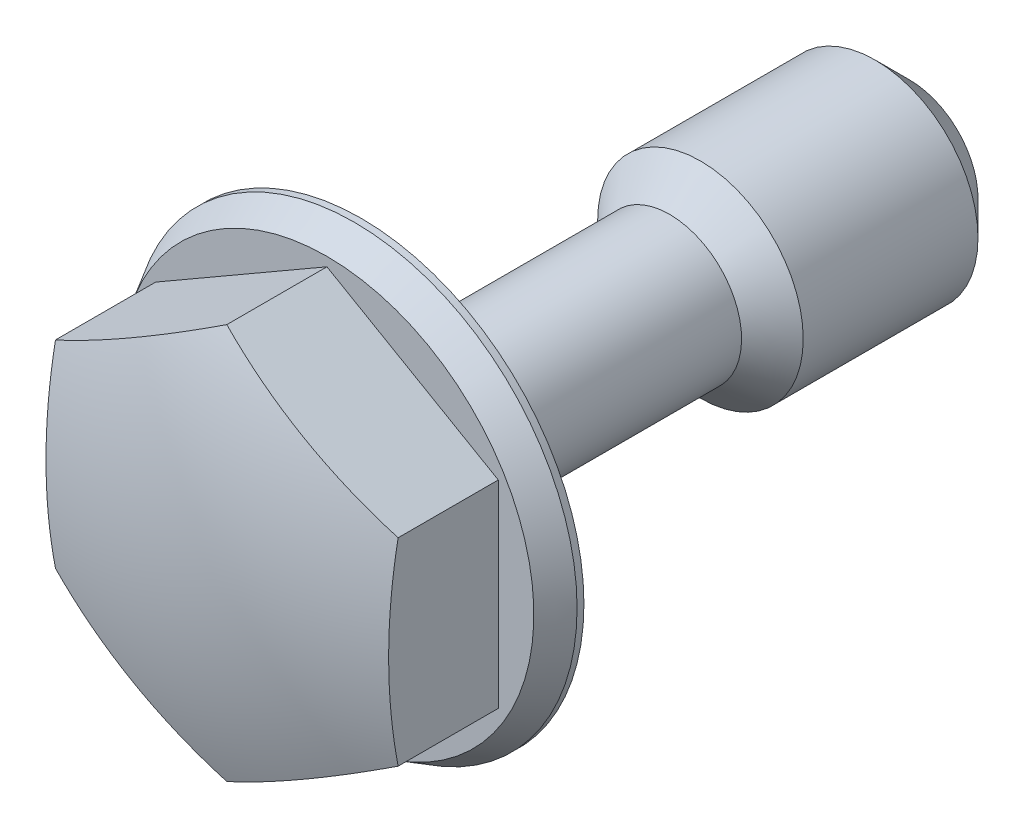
ISO-10303-21;
HEADER;
FILE_DESCRIPTION(('STEP AP214'),'2;1');
FILE_NAME('part.step','',(''),(''),'','','');
FILE_SCHEMA(('AUTOMOTIVE_DESIGN { 1 0 10303 214 1 1 1 1 }'));
ENDSEC;
DATA;
#1=APPLICATION_CONTEXT('core data for automotive mechanical design processes');
#2=APPLICATION_PROTOCOL_DEFINITION('international standard','automotive_design',2000,#1);
#3=PRODUCT_CONTEXT('',#1,'mechanical');
#4=PRODUCT('Part','Part','',(#3));
#5=PRODUCT_RELATED_PRODUCT_CATEGORY('part','',(#4));
#6=PRODUCT_DEFINITION_FORMATION('','',#4);
#7=PRODUCT_DEFINITION_CONTEXT('part definition',#1,'design');
#8=PRODUCT_DEFINITION('design','',#6,#7);
#9=PRODUCT_DEFINITION_SHAPE('','',#8);
#10=(LENGTH_UNIT() NAMED_UNIT(*) SI_UNIT(.MILLI.,.METRE.));
#11=(NAMED_UNIT(*) PLANE_ANGLE_UNIT() SI_UNIT($,.RADIAN.));
#12=(NAMED_UNIT(*) SI_UNIT($,.STERADIAN.) SOLID_ANGLE_UNIT());
#13=UNCERTAINTY_MEASURE_WITH_UNIT(LENGTH_MEASURE(1.E-05),#10,'distance_accuracy_value','');
#14=(GEOMETRIC_REPRESENTATION_CONTEXT(3) GLOBAL_UNCERTAINTY_ASSIGNED_CONTEXT((#13)) GLOBAL_UNIT_ASSIGNED_CONTEXT((#10,
#11,#12)) REPRESENTATION_CONTEXT('',''));
#15=CARTESIAN_POINT('',(0.,0.,0.));
#16=DIRECTION('',(0.,0.,1.));
#17=DIRECTION('',(1.,0.,0.));
#18=AXIS2_PLACEMENT_3D('',#15,#16,#17);
#19=CARTESIAN_POINT('',(0.,0.,1.));
#20=DIRECTION('',(0.,0.,-1.));
#21=DIRECTION('',(0.,1.,0.));
#22=AXIS2_PLACEMENT_3D('',#19,#20,#21);
#23=CONICAL_SURFACE('',#22,6.0381197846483,0.523598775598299);
#24=CARTESIAN_POINT('',(0.,0.,0.2));
#25=DIRECTION('',(0.,0.,-1.));
#26=DIRECTION('',(0.,1.,0.));
#27=AXIS2_PLACEMENT_3D('',#24,#25,#26);
#28=CIRCLE('',#27,6.5);
#29=CARTESIAN_POINT('',(0.,6.5,0.2));
#30=VERTEX_POINT('',#29);
#31=EDGE_CURVE('E117',#30,#30,#28,.T.);
#32=ORIENTED_EDGE('',*,*,#31,.F.);
#33=EDGE_LOOP('',(#32));
#34=FACE_BOUND('',#33,.T.);
#35=CARTESIAN_POINT('',(0.,0.,1.));
#36=DIRECTION('',(0.,0.,1.));
#37=DIRECTION('',(0.,-1.,0.));
#38=AXIS2_PLACEMENT_3D('',#35,#36,#37);
#39=CIRCLE('',#38,6.0381197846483);
#40=CARTESIAN_POINT('',(0.,-6.0381197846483,1.));
#41=VERTEX_POINT('',#40);
#42=EDGE_CURVE('E95',#41,#41,#39,.T.);
#43=ORIENTED_EDGE('',*,*,#42,.F.);
#44=EDGE_LOOP('',(#43));
#45=FACE_BOUND('',#44,.T.);
#46=ADVANCED_FACE('F14',(#34,#45),#23,.T.);
#47=CARTESIAN_POINT('',(0.,0.,-16.));
#48=DIRECTION('',(0.,0.,-1.));
#49=DIRECTION('',(0.,1.,0.));
#50=AXIS2_PLACEMENT_3D('',#47,#48,#49);
#51=CYLINDRICAL_SURFACE('',#50,6.5);
#52=CARTESIAN_POINT('',(0.,0.,0.));
#53=DIRECTION('',(0.,0.,-1.));
#54=DIRECTION('',(0.,1.,0.));
#55=AXIS2_PLACEMENT_3D('',#52,#53,#54);
#56=CIRCLE('',#55,6.5);
#57=CARTESIAN_POINT('',(0.,6.5,0.));
#58=VERTEX_POINT('',#57);
#59=EDGE_CURVE('E114',#58,#58,#56,.T.);
#60=ORIENTED_EDGE('',*,*,#59,.F.);
#61=EDGE_LOOP('',(#60));
#62=FACE_BOUND('',#61,.T.);
#63=ORIENTED_EDGE('',*,*,#31,.T.);
#64=EDGE_LOOP('',(#63));
#65=FACE_BOUND('',#64,.T.);
#66=ADVANCED_FACE('F156',(#62,#65),#51,.T.);
#67=CARTESIAN_POINT('',(6.5,0.,0.));
#68=DIRECTION('',(0.,0.,1.));
#69=DIRECTION('',(0.,-1.,0.));
#70=AXIS2_PLACEMENT_3D('',#67,#68,#69);
#71=PLANE('',#70);
#72=CARTESIAN_POINT('',(0.,0.,0.));
#73=DIRECTION('',(0.,0.,-1.));
#74=DIRECTION('',(0.,1.,0.));
#75=AXIS2_PLACEMENT_3D('',#72,#73,#74);
#76=CIRCLE('',#75,2.7);
#77=CARTESIAN_POINT('',(0.,2.7,0.));
#78=VERTEX_POINT('',#77);
#79=EDGE_CURVE('E111',#78,#78,#76,.T.);
#80=ORIENTED_EDGE('',*,*,#79,.F.);
#81=EDGE_LOOP('',(#80));
#82=FACE_BOUND('',#81,.T.);
#83=ORIENTED_EDGE('',*,*,#59,.T.);
#84=EDGE_LOOP('',(#83));
#85=FACE_BOUND('',#84,.T.);
#86=ADVANCED_FACE('F162',(#82,#85),#71,.F.);
#87=CARTESIAN_POINT('',(0.,0.,-0.6));
#88=DIRECTION('',(0.,0.,-1.));
#89=DIRECTION('',(0.,1.,0.));
#90=AXIS2_PLACEMENT_3D('',#87,#88,#89);
#91=TOROIDAL_SURFACE('',#90,2.7,0.6);
#92=CARTESIAN_POINT('',(0.,0.,-0.6));
#93=DIRECTION('',(0.,0.,-1.));
#94=DIRECTION('',(0.,1.,0.));
#95=AXIS2_PLACEMENT_3D('',#92,#93,#94);
#96=CIRCLE('',#95,2.1);
#97=CARTESIAN_POINT('',(0.,2.1,-0.6));
#98=VERTEX_POINT('',#97);
#99=EDGE_CURVE('E108',#98,#98,#96,.T.);
#100=ORIENTED_EDGE('',*,*,#99,.F.);
#101=EDGE_LOOP('',(#100));
#102=FACE_BOUND('',#101,.T.);
#103=ORIENTED_EDGE('',*,*,#79,.T.);
#104=EDGE_LOOP('',(#103));
#105=FACE_BOUND('',#104,.T.);
#106=ADVANCED_FACE('F196',(#102,#105),#91,.F.);
#107=CARTESIAN_POINT('',(0.,0.,-16.));
#108=DIRECTION('',(0.,0.,-1.));
#109=DIRECTION('',(0.,1.,0.));
#110=AXIS2_PLACEMENT_3D('',#107,#108,#109);
#111=CYLINDRICAL_SURFACE('',#110,2.1);
#112=CARTESIAN_POINT('',(0.,0.,-9.));
#113=DIRECTION('',(0.,0.,-1.));
#114=DIRECTION('',(0.,1.,0.));
#115=AXIS2_PLACEMENT_3D('',#112,#113,#114);
#116=CIRCLE('',#115,2.1);
#117=CARTESIAN_POINT('',(0.,2.1,-9.));
#118=VERTEX_POINT('',#117);
#119=EDGE_CURVE('E83',#118,#118,#116,.T.);
#120=ORIENTED_EDGE('',*,*,#119,.F.);
#121=EDGE_LOOP('',(#120));
#122=FACE_BOUND('',#121,.T.);
#123=ORIENTED_EDGE('',*,*,#99,.T.);
#124=EDGE_LOOP('',(#123));
#125=FACE_BOUND('',#124,.T.);
#126=ADVANCED_FACE('F193',(#122,#125),#111,.T.);
#127=CARTESIAN_POINT('',(0.,0.,1.));
#128=DIRECTION('',(0.,0.,1.));
#129=DIRECTION('',(0.,-1.,0.));
#130=AXIS2_PLACEMENT_3D('',#127,#128,#129);
#131=PLANE('',#130);
#132=DIRECTION('',(0.,-1.,0.));
#133=VECTOR('',#132,1.);
#134=CARTESIAN_POINT('',(-5.,2.88675134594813,1.));
#135=LINE('',#134,#133);
#136=CARTESIAN_POINT('',(-5.,2.88675134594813,1.));
#137=VERTEX_POINT('',#136);
#138=CARTESIAN_POINT('',(-5.,-2.88675134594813,1.));
#139=VERTEX_POINT('',#138);
#140=EDGE_CURVE('E72',#137,#139,#135,.T.);
#141=ORIENTED_EDGE('',*,*,#140,.F.);
#142=DIRECTION('',(-0.866025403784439,-0.5,0.));
#143=VECTOR('',#142,1.);
#144=CARTESIAN_POINT('',(0.,5.77350269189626,1.));
#145=LINE('',#144,#143);
#146=CARTESIAN_POINT('',(0.,5.77350269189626,1.));
#147=VERTEX_POINT('',#146);
#148=EDGE_CURVE('E88',#147,#137,#145,.T.);
#149=ORIENTED_EDGE('',*,*,#148,.F.);
#150=DIRECTION('',(-0.866025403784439,0.5,0.));
#151=VECTOR('',#150,1.);
#152=CARTESIAN_POINT('',(5.,2.88675134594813,1.));
#153=LINE('',#152,#151);
#154=CARTESIAN_POINT('',(5.,2.88675134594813,1.));
#155=VERTEX_POINT('',#154);
#156=EDGE_CURVE('E90',#155,#147,#153,.T.);
#157=ORIENTED_EDGE('',*,*,#156,.F.);
#158=DIRECTION('',(0.,1.,0.));
#159=VECTOR('',#158,1.);
#160=CARTESIAN_POINT('',(5.,-2.88675134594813,1.));
#161=LINE('',#160,#159);
#162=CARTESIAN_POINT('',(5.,-2.88675134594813,1.));
#163=VERTEX_POINT('',#162);
#164=EDGE_CURVE('E184',#163,#155,#161,.T.);
#165=ORIENTED_EDGE('',*,*,#164,.F.);
#166=DIRECTION('',(0.866025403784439,0.5,0.));
#167=VECTOR('',#166,1.);
#168=CARTESIAN_POINT('',(0.,-5.77350269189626,1.));
#169=LINE('',#168,#167);
#170=CARTESIAN_POINT('',(0.,-5.77350269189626,1.));
#171=VERTEX_POINT('',#170);
#172=EDGE_CURVE('E82',#171,#163,#169,.T.);
#173=ORIENTED_EDGE('',*,*,#172,.F.);
#174=DIRECTION('',(0.866025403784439,-0.5,0.));
#175=VECTOR('',#174,1.);
#176=CARTESIAN_POINT('',(-5.,-2.88675134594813,1.));
#177=LINE('',#176,#175);
#178=EDGE_CURVE('E68',#139,#171,#177,.T.);
#179=ORIENTED_EDGE('',*,*,#178,.F.);
#180=EDGE_LOOP('',(#141,#149,#157,#165,#173,#179));
#181=FACE_BOUND('',#180,.T.);
#182=ORIENTED_EDGE('',*,*,#42,.T.);
#183=EDGE_LOOP('',(#182));
#184=FACE_BOUND('',#183,.T.);
#185=ADVANCED_FACE('F77',(#181,#184),#131,.T.);
#186=CARTESIAN_POINT('',(-5.,2.88675134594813,1.));
#187=DIRECTION('',(-1.,0.,0.));
#188=DIRECTION('',(0.,-1.,0.));
#189=AXIS2_PLACEMENT_3D('',#186,#187,#188);
#190=PLANE('',#189);
#191=DIRECTION('',(0.,0.,1.));
#192=VECTOR('',#191,1.);
#193=CARTESIAN_POINT('',(-5.,2.88675134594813,1.));
#194=LINE('',#193,#192);
#195=CARTESIAN_POINT('',(-5.,2.88675134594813,3.92201952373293));
#196=VERTEX_POINT('',#195);
#197=EDGE_CURVE('E86',#137,#196,#194,.T.);
#198=ORIENTED_EDGE('',*,*,#197,.F.);
#199=ORIENTED_EDGE('',*,*,#140,.T.);
#200=DIRECTION('',(0.,0.,1.));
#201=VECTOR('',#200,1.);
#202=CARTESIAN_POINT('',(-5.,-2.88675134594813,1.));
#203=LINE('',#202,#201);
#204=CARTESIAN_POINT('',(-5.,-2.88675134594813,3.92201952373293));
#205=VERTEX_POINT('',#204);
#206=EDGE_CURVE('E65',#139,#205,#203,.T.);
#207=ORIENTED_EDGE('',*,*,#206,.T.);
#208=CARTESIAN_POINT('',(-5.,0.,-11.));
#209=DIRECTION('',(-1.,0.,0.));
#210=DIRECTION('',(0.,-1.,0.));
#211=AXIS2_PLACEMENT_3D('',#208,#209,#210);
#212=CIRCLE('',#211,15.1986841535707);
#213=EDGE_CURVE('E37',#196,#205,#212,.F.);
#214=ORIENTED_EDGE('',*,*,#213,.F.);
#215=EDGE_LOOP('',(#198,#199,#207,#214));
#216=FACE_BOUND('',#215,.T.);
#217=ADVANCED_FACE('F85',(#216),#190,.T.);
#218=CARTESIAN_POINT('',(0.,5.77350269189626,1.));
#219=DIRECTION('',(-0.5,0.866025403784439,0.));
#220=DIRECTION('',(-0.866025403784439,-0.5,0.));
#221=AXIS2_PLACEMENT_3D('',#218,#219,#220);
#222=PLANE('',#221);
#223=DIRECTION('',(0.,0.,1.));
#224=VECTOR('',#223,1.);
#225=CARTESIAN_POINT('',(0.,5.77350269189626,1.));
#226=LINE('',#225,#224);
#227=CARTESIAN_POINT('',(0.,5.77350269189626,3.92201952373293));
#228=VERTEX_POINT('',#227);
#229=EDGE_CURVE('E96',#147,#228,#226,.T.);
#230=ORIENTED_EDGE('',*,*,#229,.F.);
#231=ORIENTED_EDGE('',*,*,#148,.T.);
#232=ORIENTED_EDGE('',*,*,#197,.T.);
#233=CARTESIAN_POINT('',(-2.5,4.3301270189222,-11.));
#234=DIRECTION('',(-0.5,0.866025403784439,0.));
#235=DIRECTION('',(-0.866025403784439,-0.5,0.));
#236=AXIS2_PLACEMENT_3D('',#233,#234,#235);
#237=CIRCLE('',#236,15.1986841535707);
#238=EDGE_CURVE('E130',#228,#196,#237,.F.);
#239=ORIENTED_EDGE('',*,*,#238,.F.);
#240=EDGE_LOOP('',(#230,#231,#232,#239));
#241=FACE_BOUND('',#240,.T.);
#242=ADVANCED_FACE('F219',(#241),#222,.T.);
#243=CARTESIAN_POINT('',(5.,2.88675134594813,1.));
#244=DIRECTION('',(0.5,0.866025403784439,0.));
#245=DIRECTION('',(-0.866025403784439,0.5,0.));
#246=AXIS2_PLACEMENT_3D('',#243,#244,#245);
#247=PLANE('',#246);
#248=DIRECTION('',(0.,0.,1.));
#249=VECTOR('',#248,1.);
#250=CARTESIAN_POINT('',(5.,2.88675134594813,1.));
#251=LINE('',#250,#249);
#252=CARTESIAN_POINT('',(5.,2.88675134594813,3.92201952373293));
#253=VERTEX_POINT('',#252);
#254=EDGE_CURVE('E99',#155,#253,#251,.T.);
#255=ORIENTED_EDGE('',*,*,#254,.F.);
#256=ORIENTED_EDGE('',*,*,#156,.T.);
#257=ORIENTED_EDGE('',*,*,#229,.T.);
#258=CARTESIAN_POINT('',(2.5,4.3301270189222,-11.));
#259=DIRECTION('',(0.5,0.866025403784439,0.));
#260=DIRECTION('',(-0.866025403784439,0.5,0.));
#261=AXIS2_PLACEMENT_3D('',#258,#259,#260);
#262=CIRCLE('',#261,15.1986841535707);
#263=EDGE_CURVE('E127',#253,#228,#262,.F.);
#264=ORIENTED_EDGE('',*,*,#263,.F.);
#265=EDGE_LOOP('',(#255,#256,#257,#264));
#266=FACE_BOUND('',#265,.T.);
#267=ADVANCED_FACE('F178',(#266),#247,.T.);
#268=CARTESIAN_POINT('',(5.,-2.88675134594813,1.));
#269=DIRECTION('',(1.,0.,0.));
#270=DIRECTION('',(0.,1.,0.));
#271=AXIS2_PLACEMENT_3D('',#268,#269,#270);
#272=PLANE('',#271);
#273=DIRECTION('',(0.,0.,1.));
#274=VECTOR('',#273,1.);
#275=CARTESIAN_POINT('',(5.,-2.88675134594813,1.));
#276=LINE('',#275,#274);
#277=CARTESIAN_POINT('',(5.,-2.88675134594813,3.92201952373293));
#278=VERTEX_POINT('',#277);
#279=EDGE_CURVE('E102',#163,#278,#276,.T.);
#280=ORIENTED_EDGE('',*,*,#279,.F.);
#281=ORIENTED_EDGE('',*,*,#164,.T.);
#282=ORIENTED_EDGE('',*,*,#254,.T.);
#283=CARTESIAN_POINT('',(5.,0.,-11.));
#284=DIRECTION('',(1.,0.,0.));
#285=DIRECTION('',(0.,1.,0.));
#286=AXIS2_PLACEMENT_3D('',#283,#284,#285);
#287=CIRCLE('',#286,15.1986841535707);
#288=EDGE_CURVE('E124',#278,#253,#287,.F.);
#289=ORIENTED_EDGE('',*,*,#288,.F.);
#290=EDGE_LOOP('',(#280,#281,#282,#289));
#291=FACE_BOUND('',#290,.T.);
#292=ADVANCED_FACE('F183',(#291),#272,.T.);
#293=CARTESIAN_POINT('',(0.,-5.77350269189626,1.));
#294=DIRECTION('',(0.5,-0.866025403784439,0.));
#295=DIRECTION('',(0.866025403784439,0.5,0.));
#296=AXIS2_PLACEMENT_3D('',#293,#294,#295);
#297=PLANE('',#296);
#298=DIRECTION('',(0.,0.,1.));
#299=VECTOR('',#298,1.);
#300=CARTESIAN_POINT('',(0.,-5.77350269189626,1.));
#301=LINE('',#300,#299);
#302=CARTESIAN_POINT('',(0.,-5.77350269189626,3.92201952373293));
#303=VERTEX_POINT('',#302);
#304=EDGE_CURVE('E29',#171,#303,#301,.T.);
#305=ORIENTED_EDGE('',*,*,#304,.F.);
#306=ORIENTED_EDGE('',*,*,#172,.T.);
#307=ORIENTED_EDGE('',*,*,#279,.T.);
#308=CARTESIAN_POINT('',(2.5,-4.3301270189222,-11.));
#309=DIRECTION('',(0.5,-0.866025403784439,0.));
#310=DIRECTION('',(0.866025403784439,0.5,0.));
#311=AXIS2_PLACEMENT_3D('',#308,#309,#310);
#312=CIRCLE('',#311,15.1986841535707);
#313=EDGE_CURVE('E121',#303,#278,#312,.F.);
#314=ORIENTED_EDGE('',*,*,#313,.F.);
#315=EDGE_LOOP('',(#305,#306,#307,#314));
#316=FACE_BOUND('',#315,.T.);
#317=ADVANCED_FACE('F174',(#316),#297,.T.);
#318=CARTESIAN_POINT('',(-5.,-2.88675134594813,1.));
#319=DIRECTION('',(-0.5,-0.866025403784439,0.));
#320=DIRECTION('',(0.866025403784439,-0.5,0.));
#321=AXIS2_PLACEMENT_3D('',#318,#319,#320);
#322=PLANE('',#321);
#323=ORIENTED_EDGE('',*,*,#206,.F.);
#324=ORIENTED_EDGE('',*,*,#178,.T.);
#325=ORIENTED_EDGE('',*,*,#304,.T.);
#326=CARTESIAN_POINT('',(-2.5,-4.3301270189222,-11.));
#327=DIRECTION('',(-0.5,-0.866025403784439,0.));
#328=DIRECTION('',(0.866025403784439,-0.5,0.));
#329=AXIS2_PLACEMENT_3D('',#326,#327,#328);
#330=CIRCLE('',#329,15.1986841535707);
#331=EDGE_CURVE('E70',#205,#303,#330,.F.);
#332=ORIENTED_EDGE('',*,*,#331,.F.);
#333=EDGE_LOOP('',(#323,#324,#325,#332));
#334=FACE_BOUND('',#333,.T.);
#335=ADVANCED_FACE('F67',(#334),#322,.T.);
#336=CARTESIAN_POINT('',(0.,0.,-11.));
#337=DIRECTION('',(0.,0.,-1.));
#338=DIRECTION('',(1.,0.,0.));
#339=AXIS2_PLACEMENT_3D('',#336,#337,#338);
#340=SPHERICAL_SURFACE('',#339,16.);
#341=ORIENTED_EDGE('',*,*,#263,.T.);
#342=ORIENTED_EDGE('',*,*,#238,.T.);
#343=ORIENTED_EDGE('',*,*,#213,.T.);
#344=ORIENTED_EDGE('',*,*,#331,.T.);
#345=ORIENTED_EDGE('',*,*,#313,.T.);
#346=ORIENTED_EDGE('',*,*,#288,.T.);
#347=EDGE_LOOP('',(#341,#342,#343,#344,#345,#346));
#348=FACE_BOUND('',#347,.T.);
#349=ADVANCED_FACE('F152',(#348),#340,.T.);
#350=CARTESIAN_POINT('',(0.,0.,-16.));
#351=DIRECTION('',(0.,0.,1.));
#352=DIRECTION('',(0.,-1.,0.));
#353=AXIS2_PLACEMENT_3D('',#350,#351,#352);
#354=CYLINDRICAL_SURFACE('',#353,3.);
#355=CARTESIAN_POINT('',(0.,0.,-9.9));
#356=DIRECTION('',(0.,0.,-1.));
#357=DIRECTION('',(0.,1.,0.));
#358=AXIS2_PLACEMENT_3D('',#355,#356,#357);
#359=CIRCLE('',#358,3.);
#360=CARTESIAN_POINT('',(0.,3.,-9.9));
#361=VERTEX_POINT('',#360);
#362=EDGE_CURVE('E9',#361,#361,#359,.T.);
#363=ORIENTED_EDGE('',*,*,#362,.T.);
#364=EDGE_LOOP('',(#363));
#365=FACE_BOUND('',#364,.T.);
#366=CARTESIAN_POINT('',(0.,0.,-15.));
#367=DIRECTION('',(0.,0.,-1.));
#368=DIRECTION('',(0.,1.,0.));
#369=AXIS2_PLACEMENT_3D('',#366,#367,#368);
#370=CIRCLE('',#369,3.);
#371=CARTESIAN_POINT('',(0.,3.,-15.));
#372=VERTEX_POINT('',#371);
#373=EDGE_CURVE('E22',#372,#372,#370,.F.);
#374=ORIENTED_EDGE('',*,*,#373,.T.);
#375=EDGE_LOOP('',(#374));
#376=FACE_BOUND('',#375,.T.);
#377=ADVANCED_FACE('F138',(#365,#376),#354,.T.);
#378=CARTESIAN_POINT('',(0.,0.,-16.));
#379=DIRECTION('',(0.,0.,-1.));
#380=DIRECTION('',(0.,1.,0.));
#381=AXIS2_PLACEMENT_3D('',#378,#379,#380);
#382=PLANE('',#381);
#383=CARTESIAN_POINT('',(0.,0.,-16.));
#384=DIRECTION('',(0.,0.,-1.));
#385=DIRECTION('',(0.,1.,0.));
#386=AXIS2_PLACEMENT_3D('',#383,#384,#385);
#387=CIRCLE('',#386,2.);
#388=CARTESIAN_POINT('',(0.,2.,-16.));
#389=VERTEX_POINT('',#388);
#390=EDGE_CURVE('E133',#389,#389,#387,.T.);
#391=ORIENTED_EDGE('',*,*,#390,.T.);
#392=EDGE_LOOP('',(#391));
#393=FACE_BOUND('',#392,.T.);
#394=ADVANCED_FACE('F143',(#393),#382,.T.);
#395=CARTESIAN_POINT('',(0.,0.,-16.));
#396=DIRECTION('',(0.,0.,1.));
#397=DIRECTION('',(0.,-1.,0.));
#398=AXIS2_PLACEMENT_3D('',#395,#396,#397);
#399=CONICAL_SURFACE('',#398,2.,0.785398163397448);
#400=ORIENTED_EDGE('',*,*,#373,.F.);
#401=EDGE_LOOP('',(#400));
#402=FACE_BOUND('',#401,.T.);
#403=ORIENTED_EDGE('',*,*,#390,.F.);
#404=EDGE_LOOP('',(#403));
#405=FACE_BOUND('',#404,.T.);
#406=ADVANCED_FACE('F140',(#402,#405),#399,.T.);
#407=CARTESIAN_POINT('',(0.,0.,-9.9));
#408=DIRECTION('',(0.,0.,-1.));
#409=DIRECTION('',(0.,1.,0.));
#410=AXIS2_PLACEMENT_3D('',#407,#408,#409);
#411=CONICAL_SURFACE('',#410,3.,0.785398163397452);
#412=ORIENTED_EDGE('',*,*,#119,.T.);
#413=EDGE_LOOP('',(#412));
#414=FACE_BOUND('',#413,.T.);
#415=ORIENTED_EDGE('',*,*,#362,.F.);
#416=EDGE_LOOP('',(#415));
#417=FACE_BOUND('',#416,.T.);
#418=ADVANCED_FACE('F16',(#414,#417),#411,.T.);
#419=CLOSED_SHELL('',(#46,#66,#86,#106,#126,#185,#217,#242,#267,#292,#317,#335,#349,#377,#394,
#406,#418));
#420=MANIFOLD_SOLID_BREP('B1',#419);
#421=ADVANCED_BREP_SHAPE_REPRESENTATION('',(#18,#420),#14);
#422=SHAPE_DEFINITION_REPRESENTATION(#9,#421);
ENDSEC;
END-ISO-10303-21;
